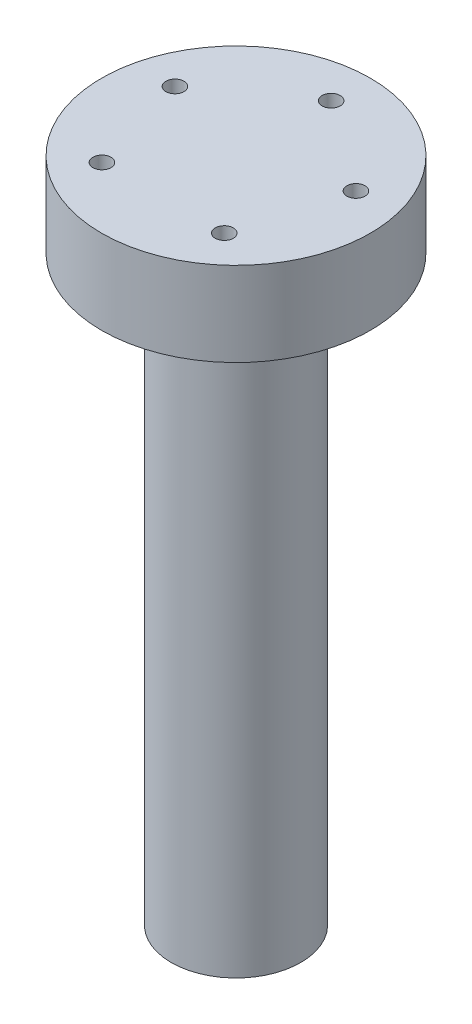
from build123d import *

# Parameters (mm, degrees)
SKETCH1_R              = 38.1
BODY_DEPTH             = 23.876
MOUNT_HOLES_DEPTH      = 59.934568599
MOUNT_HOLES_DEPTH_BACK = 59.934568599
SKETCH3_R              = 2.5654
SKETCH2_R              = 18.37055
TUBE_DEPTH             = 165.1


with BuildPart() as part:
    # Sketch1 → Body (new body)
    with BuildSketch(Plane(origin=(0, 0, 0), x_dir=(1, 0, 0), z_dir=(0, 1, 0))):
        with Locations(Location((0, 0, 0), (0, 0, 270))):
            Circle(SKETCH1_R)
    extrude(amount=BODY_DEPTH)

    # Sketch3 → Mount Holes (cut, two sides: drawn at the far end of the back side and taken through both)
    with BuildSketch(Plane(origin=(0, 23.876, 0), x_dir=(1, 0, 0), z_dir=(0, 1, 0)).offset(-MOUNT_HOLES_DEPTH_BACK)):
        with Locations(Location((0, 26.9875, 0), (0, 0, 270))):
            Circle(SKETCH3_R)
        with Locations(Location((25.666637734, 8.339596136, 0), (0, 0, 270))):
            Circle(SKETCH3_R)
        with Locations(Location((17.347230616, -20.673624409, 0), (0, 0, 270))):
            Circle(SKETCH3_R)
        with Locations(Location((-17.347230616, -20.673624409, 0), (0, 0, 270))):
            Circle(SKETCH3_R)
        with Locations(Location((-25.666637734, 8.339596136, 0), (0, 0, 270))):
            Circle(SKETCH3_R)
    extrude(amount=MOUNT_HOLES_DEPTH + MOUNT_HOLES_DEPTH_BACK, mode=Mode.SUBTRACT)

    # Sketch2 → Tube (add)
    with BuildSketch(Plane(origin=(0, 0, 0), x_dir=(1, 0, 0), z_dir=(0, 1, 0))):
        with Locations(Location((0, 0, 0), (0, 0, 270))):
            Circle(SKETCH2_R)
    extrude(amount=-TUBE_DEPTH)


solid = part.part
